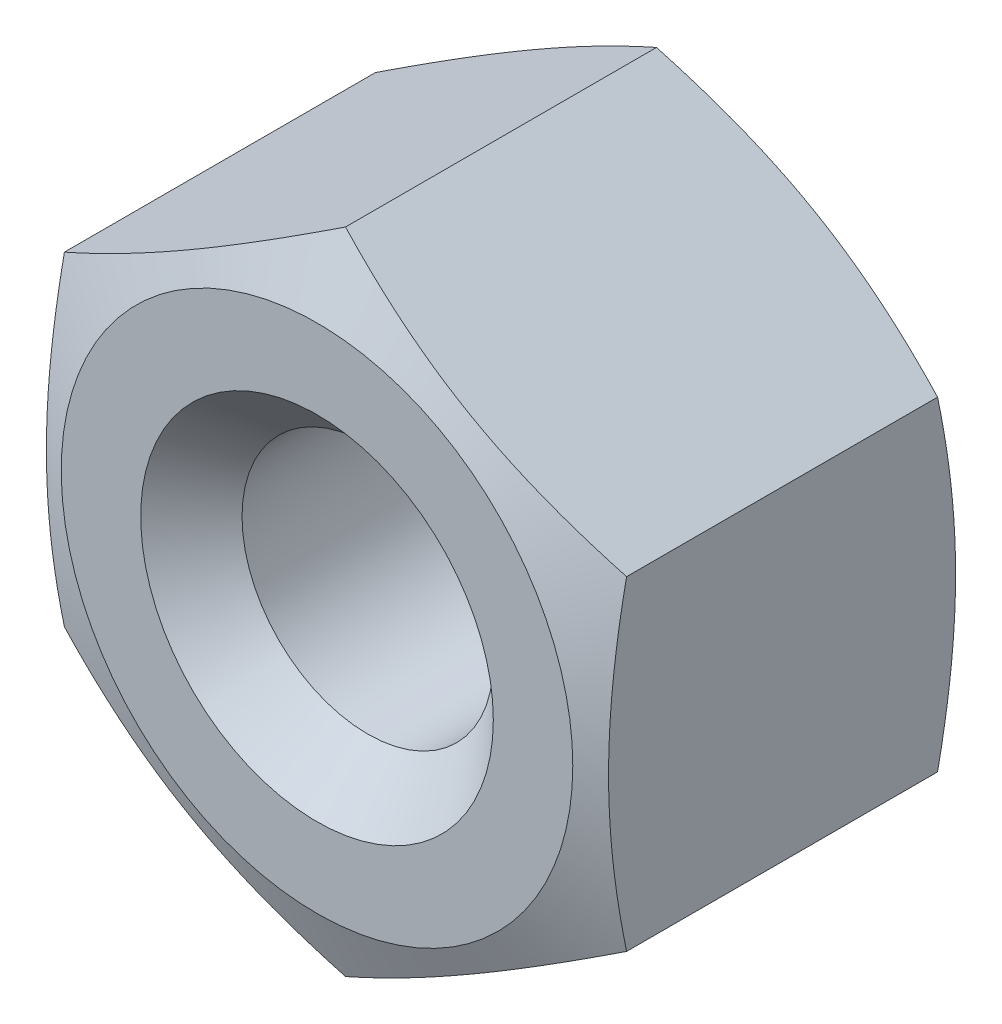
ISO-10303-21;
HEADER;
FILE_DESCRIPTION(('STEP AP214'),'2;1');
FILE_NAME('part.step','',(''),(''),'','','');
FILE_SCHEMA(('AUTOMOTIVE_DESIGN { 1 0 10303 214 1 1 1 1 }'));
ENDSEC;
DATA;
#1=APPLICATION_CONTEXT('core data for automotive mechanical design processes');
#2=APPLICATION_PROTOCOL_DEFINITION('international standard','automotive_design',2000,#1);
#3=PRODUCT_CONTEXT('',#1,'mechanical');
#4=PRODUCT('Part','Part','',(#3));
#5=PRODUCT_RELATED_PRODUCT_CATEGORY('part','',(#4));
#6=PRODUCT_DEFINITION_FORMATION('','',#4);
#7=PRODUCT_DEFINITION_CONTEXT('part definition',#1,'design');
#8=PRODUCT_DEFINITION('design','',#6,#7);
#9=PRODUCT_DEFINITION_SHAPE('','',#8);
#10=(LENGTH_UNIT() NAMED_UNIT(*) SI_UNIT(.MILLI.,.METRE.));
#11=(NAMED_UNIT(*) PLANE_ANGLE_UNIT() SI_UNIT($,.RADIAN.));
#12=(NAMED_UNIT(*) SI_UNIT($,.STERADIAN.) SOLID_ANGLE_UNIT());
#13=UNCERTAINTY_MEASURE_WITH_UNIT(LENGTH_MEASURE(1.E-05),#10,'distance_accuracy_value','');
#14=(GEOMETRIC_REPRESENTATION_CONTEXT(3) GLOBAL_UNCERTAINTY_ASSIGNED_CONTEXT((#13)) GLOBAL_UNIT_ASSIGNED_CONTEXT((#10,
#11,#12)) REPRESENTATION_CONTEXT('',''));
#15=CARTESIAN_POINT('',(0.,0.,0.));
#16=DIRECTION('',(0.,0.,1.));
#17=DIRECTION('',(1.,0.,0.));
#18=AXIS2_PLACEMENT_3D('',#15,#16,#17);
#19=CARTESIAN_POINT('',(0.,0.,0.));
#20=DIRECTION('',(0.,0.,1.));
#21=DIRECTION('',(1.,0.,0.));
#22=AXIS2_PLACEMENT_3D('',#19,#20,#21);
#23=PLANE('',#22);
#24=CARTESIAN_POINT('',(0.,0.,0.));
#25=DIRECTION('',(0.,0.,1.));
#26=DIRECTION('',(1.,0.,0.));
#27=AXIS2_PLACEMENT_3D('',#24,#25,#26);
#28=CIRCLE('',#27,1.725);
#29=CARTESIAN_POINT('',(1.725,0.,0.));
#30=VERTEX_POINT('',#29);
#31=EDGE_CURVE('E182',#30,#30,#28,.T.);
#32=ORIENTED_EDGE('',*,*,#31,.T.);
#33=EDGE_LOOP('',(#32));
#34=FACE_BOUND('',#33,.T.);
#35=CARTESIAN_POINT('',(0.,0.,0.));
#36=DIRECTION('',(0.,0.,1.));
#37=DIRECTION('',(1.,0.,0.));
#38=AXIS2_PLACEMENT_3D('',#35,#36,#37);
#39=CIRCLE('',#38,2.50241421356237);
#40=CARTESIAN_POINT('',(2.50241421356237,0.,0.));
#41=VERTEX_POINT('',#40);
#42=EDGE_CURVE('E270',#41,#41,#39,.T.);
#43=ORIENTED_EDGE('',*,*,#42,.F.);
#44=EDGE_LOOP('',(#43));
#45=FACE_BOUND('',#44,.T.);
#46=ADVANCED_FACE('F86',(#34,#45),#23,.F.);
#47=CARTESIAN_POINT('',(0.,-3.17542648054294,3.6));
#48=DIRECTION('',(-0.5,0.866025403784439,0.));
#49=DIRECTION('',(-0.866025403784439,-0.5,0.));
#50=AXIS2_PLACEMENT_3D('',#47,#48,#49);
#51=PLANE('',#50);
#52=CARTESIAN_POINT('',(2.7502,-1.58759777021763,0.278818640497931));
#53=CARTESIAN_POINT('',(2.65649248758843,-1.64169982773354,0.256405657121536));
#54=CARTESIAN_POINT('',(2.5624696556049,-1.69598393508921,0.235635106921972));
#55=CARTESIAN_POINT('',(2.37378809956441,-1.8049192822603,0.19798956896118));
#56=CARTESIAN_POINT('',(2.27912903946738,-1.85957071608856,0.181116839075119));
#57=CARTESIAN_POINT('',(2.08928522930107,-1.96917709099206,0.151906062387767));
#58=CARTESIAN_POINT('',(1.99410051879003,-2.02413200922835,0.139567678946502));
#59=CARTESIAN_POINT('',(1.80335450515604,-2.13425927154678,0.11997473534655));
#60=CARTESIAN_POINT('',(1.70779328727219,-2.18943156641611,0.112719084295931));
#61=CARTESIAN_POINT('',(1.51815924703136,-2.29891683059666,0.103732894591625));
#62=CARTESIAN_POINT('',(1.42408985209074,-2.35322782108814,0.101907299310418));
#63=CARTESIAN_POINT('',(1.23597987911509,-2.46183316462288,0.103605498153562));
#64=CARTESIAN_POINT('',(1.14193930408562,-2.51612751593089,0.107129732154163));
#65=CARTESIAN_POINT('',(0.95418505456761,-2.62452748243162,0.119343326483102));
#66=CARTESIAN_POINT('',(0.860471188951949,-2.67863320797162,0.12802884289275));
#67=CARTESIAN_POINT('',(0.673466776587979,-2.7866002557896,0.150153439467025));
#68=CARTESIAN_POINT('',(0.580176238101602,-2.84046157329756,0.163592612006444));
#69=CARTESIAN_POINT('',(0.446409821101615,-2.91769165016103,0.185940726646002));
#70=CARTESIAN_POINT('',(0.405714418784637,-2.94118715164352,0.193151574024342));
#71=CARTESIAN_POINT('',(0.324435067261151,-2.98811380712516,0.208328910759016));
#72=CARTESIAN_POINT('',(0.283851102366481,-3.01154497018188,0.21629528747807));
#73=CARTESIAN_POINT('',(0.202626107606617,-3.05844024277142,0.232968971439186));
#74=CARTESIAN_POINT('',(0.161985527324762,-3.08190409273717,0.241679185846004));
#75=CARTESIAN_POINT('',(0.0808114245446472,-3.12876998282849,0.25976349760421));
#76=CARTESIAN_POINT('',(0.0402779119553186,-3.15217201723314,0.26913765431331));
#77=CARTESIAN_POINT('',(-0.000199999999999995,-3.17554195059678,0.278818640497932));
#78=B_SPLINE_CURVE_WITH_KNOTS('',3,(#52,#53,#54,#55,#56,#57,#58,#59,#60,#61,#62,#63,#64,#65,#66,
#67,#68,#69,#70,#71,#72,#73,#74,#75,#76,#77),.UNSPECIFIED.,.F.,.F.,(4,2,2,2,2,2,2,2,2,2,2,2,4),
(0.,0.331525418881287,0.663242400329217,0.994934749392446,1.32655588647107,1.65233657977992,
1.9781440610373,2.30370919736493,2.62928066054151,2.77189936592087,2.91449684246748,
3.05767965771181,3.20087528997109),.UNSPECIFIED.);
#79=CARTESIAN_POINT('',(2.75,-1.58771324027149,0.278770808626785));
#80=VERTEX_POINT('',#79);
#81=CARTESIAN_POINT('',(0.,-3.17542648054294,0.278770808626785));
#82=VERTEX_POINT('',#81);
#83=EDGE_CURVE('E106',#80,#82,#78,.T.);
#84=ORIENTED_EDGE('',*,*,#83,.F.);
#85=DIRECTION('',(0.,0.,-1.));
#86=VECTOR('',#85,1.);
#87=CARTESIAN_POINT('',(2.75,-1.58771324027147,3.6));
#88=LINE('',#87,#86);
#89=CARTESIAN_POINT('',(2.75,-1.58771324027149,3.32122919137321));
#90=VERTEX_POINT('',#89);
#91=EDGE_CURVE('E173',#90,#80,#88,.T.);
#92=ORIENTED_EDGE('',*,*,#91,.F.);
#93=CARTESIAN_POINT('',(2.7502,-1.58759777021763,3.32118135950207));
#94=CARTESIAN_POINT('',(2.65649248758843,-1.64169982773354,3.34359434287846));
#95=CARTESIAN_POINT('',(2.5624696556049,-1.69598393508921,3.36436489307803));
#96=CARTESIAN_POINT('',(2.37378809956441,-1.8049192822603,3.40201043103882));
#97=CARTESIAN_POINT('',(2.27912903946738,-1.85957071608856,3.41888316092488));
#98=CARTESIAN_POINT('',(2.08928522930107,-1.96917709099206,3.44809393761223));
#99=CARTESIAN_POINT('',(1.99410051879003,-2.02413200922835,3.46043232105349));
#100=CARTESIAN_POINT('',(1.80335450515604,-2.13425927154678,3.48002526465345));
#101=CARTESIAN_POINT('',(1.70779328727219,-2.18943156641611,3.48728091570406));
#102=CARTESIAN_POINT('',(1.51815924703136,-2.29891683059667,3.49626710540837));
#103=CARTESIAN_POINT('',(1.42408985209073,-2.35322782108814,3.49809270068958));
#104=CARTESIAN_POINT('',(1.23597987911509,-2.46183316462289,3.49639450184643));
#105=CARTESIAN_POINT('',(1.14193930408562,-2.5161275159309,3.49287026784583));
#106=CARTESIAN_POINT('',(0.954185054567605,-2.62452748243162,3.4806566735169));
#107=CARTESIAN_POINT('',(0.860471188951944,-2.67863320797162,3.47197115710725));
#108=CARTESIAN_POINT('',(0.673466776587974,-2.78660025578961,3.44984656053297));
#109=CARTESIAN_POINT('',(0.580176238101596,-2.84046157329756,3.43640738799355));
#110=CARTESIAN_POINT('',(0.446409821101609,-2.91769165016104,3.41405927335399));
#111=CARTESIAN_POINT('',(0.405714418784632,-2.94118715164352,3.40684842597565));
#112=CARTESIAN_POINT('',(0.324435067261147,-2.98811380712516,3.39167108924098));
#113=CARTESIAN_POINT('',(0.283851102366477,-3.01154497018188,3.38370471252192));
#114=CARTESIAN_POINT('',(0.202626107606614,-3.05844024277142,3.36703102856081));
#115=CARTESIAN_POINT('',(0.16198552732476,-3.08190409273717,3.35832081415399));
#116=CARTESIAN_POINT('',(0.0808114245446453,-3.12876998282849,3.34023650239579));
#117=CARTESIAN_POINT('',(0.0402779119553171,-3.15217201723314,3.33086234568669));
#118=CARTESIAN_POINT('',(-0.000200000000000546,-3.17554195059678,3.32118135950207));
#119=B_SPLINE_CURVE_WITH_KNOTS('',3,(#93,#94,#95,#96,#97,#98,#99,#100,#101,#102,#103,#104,#105,
#106,#107,#108,#109,#110,#111,#112,#113,#114,#115,#116,#117,#118),.UNSPECIFIED.,.F.,.F.,(4,2,2,
2,2,2,2,2,2,2,2,2,4),(0.,0.331525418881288,0.663242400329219,0.994934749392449,1.32655588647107,
1.65233657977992,1.97814406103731,2.30370919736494,2.62928066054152,2.77189936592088,
2.91449684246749,3.05767965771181,3.20087528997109),.UNSPECIFIED.);
#120=CARTESIAN_POINT('',(0.,-3.17542648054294,3.32122919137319));
#121=VERTEX_POINT('',#120);
#122=EDGE_CURVE('E237',#90,#121,#119,.T.);
#123=ORIENTED_EDGE('',*,*,#122,.T.);
#124=DIRECTION('',(0.,0.,-1.));
#125=VECTOR('',#124,1.);
#126=CARTESIAN_POINT('',(0.,-3.17542648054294,3.6));
#127=LINE('',#126,#125);
#128=EDGE_CURVE('E160',#121,#82,#127,.T.);
#129=ORIENTED_EDGE('',*,*,#128,.T.);
#130=EDGE_LOOP('',(#84,#92,#123,#129));
#131=FACE_BOUND('',#130,.T.);
#132=ADVANCED_FACE('F247',(#131),#51,.F.);
#133=CARTESIAN_POINT('',(2.75,-1.58771324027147,3.6));
#134=DIRECTION('',(-1.,0.,0.));
#135=DIRECTION('',(0.,-1.,0.));
#136=AXIS2_PLACEMENT_3D('',#133,#134,#135);
#137=PLANE('',#136);
#138=CARTESIAN_POINT('',(2.75,-4.25926884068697,1.06348682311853));
#139=CARTESIAN_POINT('',(2.75,-4.13436725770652,1.02003517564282));
#140=CARTESIAN_POINT('',(2.75,-4.00929566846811,0.977063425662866));
#141=CARTESIAN_POINT('',(2.75,-3.7587236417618,0.892349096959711));
#142=CARTESIAN_POINT('',(2.75,-3.63322316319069,0.850606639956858));
#143=CARTESIAN_POINT('',(2.75,-3.38144046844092,0.768534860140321));
#144=CARTESIAN_POINT('',(2.75,-3.25515711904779,0.728209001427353));
#145=CARTESIAN_POINT('',(2.75,-3.00200316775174,0.649449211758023));
#146=CARTESIAN_POINT('',(2.75,-2.8751325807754,0.611015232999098));
#147=CARTESIAN_POINT('',(2.75,-2.62284671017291,0.537150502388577));
#148=CARTESIAN_POINT('',(2.75,-2.4974431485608,0.501679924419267));
#149=CARTESIAN_POINT('',(2.75,-2.24584835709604,0.433618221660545));
#150=CARTESIAN_POINT('',(2.75,-2.11965710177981,0.401027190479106));
#151=CARTESIAN_POINT('',(2.75,-1.86644410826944,0.339479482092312));
#152=CARTESIAN_POINT('',(2.75,-1.73942279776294,0.310521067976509));
#153=CARTESIAN_POINT('',(2.75,-1.48444023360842,0.257109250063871));
#154=CARTESIAN_POINT('',(2.75,-1.35647899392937,0.232655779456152));
#155=CARTESIAN_POINT('',(2.75,-1.02858663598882,0.177293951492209));
#156=CARTESIAN_POINT('',(2.75,-0.82795199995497,0.150283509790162));
#157=CARTESIAN_POINT('',(2.75,-0.5259343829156,0.122482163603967));
#158=CARTESIAN_POINT('',(2.75,-0.425118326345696,0.115334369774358));
#159=CARTESIAN_POINT('',(2.75,-0.223261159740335,0.105548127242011));
#160=CARTESIAN_POINT('',(2.75,-0.122220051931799,0.102909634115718));
#161=CARTESIAN_POINT('',(2.75,0.0806508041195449,0.102262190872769));
#162=CARTESIAN_POINT('',(2.75,0.18248066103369,0.104288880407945));
#163=CARTESIAN_POINT('',(2.75,0.385944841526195,0.11295245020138));
#164=CARTESIAN_POINT('',(2.75,0.487579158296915,0.119589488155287));
#165=CARTESIAN_POINT('',(2.75,0.690541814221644,0.13719619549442));
#166=CARTESIAN_POINT('',(2.75,0.791869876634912,0.148169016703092));
#167=CARTESIAN_POINT('',(2.75,0.994008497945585,0.174026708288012));
#168=CARTESIAN_POINT('',(2.75,1.09481910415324,0.188911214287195));
#169=CARTESIAN_POINT('',(2.75,1.3781699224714,0.235696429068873));
#170=CARTESIAN_POINT('',(2.75,1.56005795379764,0.271552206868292));
#171=CARTESIAN_POINT('',(2.75,1.92197705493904,0.351734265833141));
#172=CARTESIAN_POINT('',(2.75,2.10200732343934,0.396064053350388));
#173=CARTESIAN_POINT('',(2.75,2.46067602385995,0.490918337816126));
#174=CARTESIAN_POINT('',(2.75,2.63931218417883,0.541451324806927));
#175=CARTESIAN_POINT('',(2.75,2.99527415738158,0.646963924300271));
#176=CARTESIAN_POINT('',(2.75,3.17259982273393,0.701944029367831));
#177=CARTESIAN_POINT('',(2.75,3.52716056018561,0.81545260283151));
#178=CARTESIAN_POINT('',(2.75,3.70438998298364,0.87399861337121));
#179=CARTESIAN_POINT('',(2.75,4.05802971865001,0.993521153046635));
#180=CARTESIAN_POINT('',(2.75,4.23444000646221,1.05449775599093));
#181=CARTESIAN_POINT('',(2.75,4.58663196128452,1.17828972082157));
#182=CARTESIAN_POINT('',(2.75,4.76241356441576,1.24110526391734));
#183=CARTESIAN_POINT('',(2.75,5.11346735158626,1.36814481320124));
#184=CARTESIAN_POINT('',(2.75,5.28873953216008,1.4323688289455));
#185=CARTESIAN_POINT('',(2.75,5.63475370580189,1.56039185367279));
#186=CARTESIAN_POINT('',(2.75,5.80550518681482,1.62416525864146));
#187=CARTESIAN_POINT('',(2.75,6.1466834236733,1.75254586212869));
#188=CARTESIAN_POINT('',(2.75,6.31711019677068,1.81715301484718));
#189=CARTESIAN_POINT('',(2.75,6.65775203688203,1.94706166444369));
#190=CARTESIAN_POINT('',(2.75,6.82796703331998,2.01236334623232));
#191=CARTESIAN_POINT('',(2.75,7.16818507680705,2.14352382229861));
#192=CARTESIAN_POINT('',(2.75,7.33818812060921,2.20938262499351));
#193=CARTESIAN_POINT('',(2.75,7.84380976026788,2.4060363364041));
#194=CARTESIAN_POINT('',(2.75,8.17917194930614,2.53749006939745));
#195=CARTESIAN_POINT('',(2.75,8.84929277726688,2.80165013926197));
#196=CARTESIAN_POINT('',(2.75,9.18405156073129,2.93435610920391));
#197=CARTESIAN_POINT('',(2.75,9.51864689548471,3.06746636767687));
#198=B_SPLINE_CURVE_WITH_KNOTS('',3,(#138,#139,#140,#141,#142,#143,#144,#145,#146,#147,#148,
#149,#150,#151,#152,#153,#154,#155,#156,#157,#158,#159,#160,#161,#162,#163,#164,#165,#166,#167,
#168,#169,#170,#171,#172,#173,#174,#175,#176,#177,#178,#179,#180,#181,#182,#183,#184,#185,#186,
#187,#188,#189,#190,#191,#192,#193,#194,#195,#196,#197),.UNSPECIFIED.,.F.,.F.,(4,2,2,2,2,2,2,2,
2,2,2,2,2,2,2,2,2,2,2,2,2,2,2,2,2,2,2,2,2,4),(0.,0.396735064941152,0.793509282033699,
1.19119436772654,1.58886939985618,1.97981234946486,2.37076800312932,2.76153600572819,
3.15229821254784,3.75895018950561,4.06207230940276,4.36519144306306,4.67063393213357,
4.97608686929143,5.28176225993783,5.58740918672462,6.1432669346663,6.69935518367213,
7.2562131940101,7.81313296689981,8.37305712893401,8.93299830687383,9.49299484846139,
10.0529951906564,10.5998087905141,11.1465924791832,11.6935255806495,12.2404669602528,
13.321079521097,14.4013847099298),.UNSPECIFIED.);
#199=CARTESIAN_POINT('',(2.75,1.58771324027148,0.278770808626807));
#200=VERTEX_POINT('',#199);
#201=EDGE_CURVE('E253',#200,#80,#198,.F.);
#202=ORIENTED_EDGE('',*,*,#201,.F.);
#203=DIRECTION('',(0.,0.,-1.));
#204=VECTOR('',#203,1.);
#205=CARTESIAN_POINT('',(2.75,1.58771324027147,3.6));
#206=LINE('',#205,#204);
#207=CARTESIAN_POINT('',(2.75,1.58771324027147,3.32122919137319));
#208=VERTEX_POINT('',#207);
#209=EDGE_CURVE('E170',#208,#200,#206,.T.);
#210=ORIENTED_EDGE('',*,*,#209,.F.);
#211=CARTESIAN_POINT('',(2.75,-4.26202370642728,2.5355544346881));
#212=CARTESIAN_POINT('',(2.75,-4.13707946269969,2.57902920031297));
#213=CARTESIAN_POINT('',(2.75,-4.01196530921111,2.62202442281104));
#214=CARTESIAN_POINT('',(2.75,-3.761308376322,2.70678657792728));
#215=CARTESIAN_POINT('',(2.75,-3.63576555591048,2.74855338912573));
#216=CARTESIAN_POINT('',(2.75,-3.38390010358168,2.83067441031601));
#217=CARTESIAN_POINT('',(2.75,-3.25757634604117,2.87102518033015));
#218=CARTESIAN_POINT('',(2.75,-3.00434180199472,2.94983613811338));
#219=CARTESIAN_POINT('',(2.75,-2.87743103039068,2.9882963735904));
#220=CARTESIAN_POINT('',(2.75,-2.62508805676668,3.06220818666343));
#221=CARTESIAN_POINT('',(2.75,-2.49966769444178,3.09769997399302));
#222=CARTESIAN_POINT('',(2.75,-2.24803968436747,3.16580698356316));
#223=CARTESIAN_POINT('',(2.75,-2.1218320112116,3.19842211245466));
#224=CARTESIAN_POINT('',(2.75,-1.86858515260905,3.26002174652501));
#225=CARTESIAN_POINT('',(2.75,-1.74154638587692,3.28900795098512));
#226=CARTESIAN_POINT('',(2.75,-1.4865287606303,3.34247902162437));
#227=CARTESIAN_POINT('',(2.75,-1.35854991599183,3.36696395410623));
#228=CARTESIAN_POINT('',(2.75,-1.03059250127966,3.42241401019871));
#229=CARTESIAN_POINT('',(2.75,-0.829909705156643,3.44948251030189));
#230=CARTESIAN_POINT('',(2.75,-0.527817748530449,3.47737105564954));
#231=CARTESIAN_POINT('',(2.75,-0.42697725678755,3.48454791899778));
#232=CARTESIAN_POINT('',(2.75,-0.225069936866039,3.49439122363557));
#233=CARTESIAN_POINT('',(2.75,-0.12400311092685,3.49705770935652));
#234=CARTESIAN_POINT('',(2.75,0.078935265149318,3.49775905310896));
#235=CARTESIAN_POINT('',(2.75,0.180806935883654,3.49575757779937));
#236=CARTESIAN_POINT('',(2.75,0.384355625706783,3.48713964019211));
#237=CARTESIAN_POINT('',(2.75,0.486032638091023,3.48052302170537));
#238=CARTESIAN_POINT('',(2.75,0.689082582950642,3.46295174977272));
#239=CARTESIAN_POINT('',(2.75,0.790455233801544,3.45199388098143));
#240=CARTESIAN_POINT('',(2.75,0.992682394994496,3.42616075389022));
#241=CARTESIAN_POINT('',(2.75,1.09353695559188,3.41128588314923));
#242=CARTESIAN_POINT('',(2.75,1.38109653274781,3.36384727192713));
#243=CARTESIAN_POINT('',(2.75,1.56710696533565,3.32706660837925));
#244=CARTESIAN_POINT('',(2.75,1.93719042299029,3.24470307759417));
#245=CARTESIAN_POINT('',(2.75,2.12126255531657,3.19911632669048));
#246=CARTESIAN_POINT('',(2.75,2.48799540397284,3.10154679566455));
#247=CARTESIAN_POINT('',(2.75,2.6706534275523,3.04955401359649));
#248=CARTESIAN_POINT('',(2.75,3.03457024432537,2.94102937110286));
#249=CARTESIAN_POINT('',(2.75,3.21582925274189,2.88449822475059));
#250=CARTESIAN_POINT('',(2.75,3.57839797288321,2.76777619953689));
#251=CARTESIAN_POINT('',(2.75,3.75970104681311,2.70756482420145));
#252=CARTESIAN_POINT('',(2.75,4.12147218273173,2.58467809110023));
#253=CARTESIAN_POINT('',(2.75,4.30194022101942,2.52200266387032));
#254=CARTESIAN_POINT('',(2.75,4.66205870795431,2.39486012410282));
#255=CARTESIAN_POINT('',(2.75,4.84170974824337,2.33039468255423));
#256=CARTESIAN_POINT('',(2.75,5.20049764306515,2.20004669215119));
#257=CARTESIAN_POINT('',(2.75,5.3796344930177,2.13416413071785));
#258=CARTESIAN_POINT('',(2.75,5.90765979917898,1.93813710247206));
#259=CARTESIAN_POINT('',(2.75,6.25597901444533,1.80646077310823));
#260=CARTESIAN_POINT('',(2.75,6.95169162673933,1.54042009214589));
#261=CARTESIAN_POINT('',(2.75,7.29908474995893,1.40605502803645));
#262=CARTESIAN_POINT('',(2.75,7.98887957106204,1.13719779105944));
#263=CARTESIAN_POINT('',(2.75,8.33128989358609,1.00272771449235));
#264=CARTESIAN_POINT('',(2.75,9.01550460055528,0.732549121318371));
#265=CARTESIAN_POINT('',(2.75,9.35730913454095,0.59684098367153));
#266=CARTESIAN_POINT('',(2.75,9.69895168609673,0.460731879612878));
#267=B_SPLINE_CURVE_WITH_KNOTS('',3,(#211,#212,#213,#214,#215,#216,#217,#218,#219,#220,#221,
#222,#223,#224,#225,#226,#227,#228,#229,#230,#231,#232,#233,#234,#235,#236,#237,#238,#239,#240,
#241,#242,#243,#244,#245,#246,#247,#248,#249,#250,#251,#252,#253,#254,#255,#256,#257,#258,#259,
#260,#261,#262,#263,#264,#265,#266),.UNSPECIFIED.,.F.,.F.,(4,2,2,2,2,2,2,2,2,2,2,2,2,2,2,2,2,2,
2,2,2,2,2,2,2,2,2,4),(0.,0.39687872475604,0.793796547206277,1.19161986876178,1.58943314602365,
1.98044197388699,2.37146348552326,2.76230120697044,3.15313317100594,3.75995203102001,
4.06315343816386,4.36635185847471,4.67191810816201,4.97749469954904,5.28329804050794,
5.58907113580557,6.15757836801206,6.72633689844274,7.2959949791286,7.86556360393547,
8.43865954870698,9.01177166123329,9.5843656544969,10.1569647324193,11.2740769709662,
12.391489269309,13.4950908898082,14.5983653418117),.UNSPECIFIED.);
#268=EDGE_CURVE('E230',#208,#90,#267,.F.);
#269=ORIENTED_EDGE('',*,*,#268,.T.);
#270=ORIENTED_EDGE('',*,*,#91,.T.);
#271=EDGE_LOOP('',(#202,#210,#269,#270));
#272=FACE_BOUND('',#271,.T.);
#273=ADVANCED_FACE('F243',(#272),#137,.F.);
#274=CARTESIAN_POINT('',(2.75,1.58771324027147,3.6));
#275=DIRECTION('',(-0.5,-0.866025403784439,0.));
#276=DIRECTION('',(0.866025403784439,-0.5,0.));
#277=AXIS2_PLACEMENT_3D('',#274,#275,#276);
#278=PLANE('',#277);
#279=CARTESIAN_POINT('',(-0.000200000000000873,3.17554195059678,0.278818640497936));
#280=CARTESIAN_POINT('',(0.0935075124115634,3.12143989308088,0.256405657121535));
#281=CARTESIAN_POINT('',(0.187530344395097,3.06715578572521,0.235635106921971));
#282=CARTESIAN_POINT('',(0.37621190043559,2.95822043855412,0.19798956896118));
#283=CARTESIAN_POINT('',(0.470870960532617,2.90356900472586,0.181116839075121));
#284=CARTESIAN_POINT('',(0.660714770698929,2.79396262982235,0.151906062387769));
#285=CARTESIAN_POINT('',(0.75589948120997,2.73900771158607,0.139567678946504));
#286=CARTESIAN_POINT('',(0.94664549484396,2.62888044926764,0.119974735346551));
#287=CARTESIAN_POINT('',(1.04220671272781,2.57370815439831,0.112719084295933));
#288=CARTESIAN_POINT('',(1.23184075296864,2.46422289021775,0.103732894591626));
#289=CARTESIAN_POINT('',(1.32591014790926,2.40991189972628,0.101907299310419));
#290=CARTESIAN_POINT('',(1.51402012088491,2.30130655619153,0.103605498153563));
#291=CARTESIAN_POINT('',(1.60806069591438,2.24701220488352,0.107129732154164));
#292=CARTESIAN_POINT('',(1.79581494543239,2.1386122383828,0.119343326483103));
#293=CARTESIAN_POINT('',(1.88952881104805,2.0845065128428,0.128028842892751));
#294=CARTESIAN_POINT('',(2.07653322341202,1.97653946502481,0.150153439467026));
#295=CARTESIAN_POINT('',(2.1698237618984,1.92267814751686,0.163592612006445));
#296=CARTESIAN_POINT('',(2.30359017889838,1.84544807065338,0.185940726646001));
#297=CARTESIAN_POINT('',(2.34428558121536,1.8219525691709,0.193151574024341));
#298=CARTESIAN_POINT('',(2.42556493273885,1.77502591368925,0.208328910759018));
#299=CARTESIAN_POINT('',(2.46614889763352,1.75159475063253,0.216295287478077));
#300=CARTESIAN_POINT('',(2.54737389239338,1.704699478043,0.232968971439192));
#301=CARTESIAN_POINT('',(2.58801447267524,1.68123562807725,0.241679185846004));
#302=CARTESIAN_POINT('',(2.66918857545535,1.63436973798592,0.259763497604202));
#303=CARTESIAN_POINT('',(2.70972208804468,1.61096770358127,0.2691376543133));
#304=CARTESIAN_POINT('',(2.7502,1.58759777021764,0.278818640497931));
#305=B_SPLINE_CURVE_WITH_KNOTS('',3,(#279,#280,#281,#282,#283,#284,#285,#286,#287,#288,#289,
#290,#291,#292,#293,#294,#295,#296,#297,#298,#299,#300,#301,#302,#303,#304),.UNSPECIFIED.,.F.,
.F.,(4,2,2,2,2,2,2,2,2,2,2,2,4),(0.,0.331525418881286,0.663242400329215,0.994934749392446,
1.32655588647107,1.65233657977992,1.97814406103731,2.30370919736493,2.62928066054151,
2.77189936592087,2.91449684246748,3.05767965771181,3.20087528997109),.UNSPECIFIED.);
#306=CARTESIAN_POINT('',(0.,3.17542648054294,0.278770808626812));
#307=VERTEX_POINT('',#306);
#308=EDGE_CURVE('E260',#307,#200,#305,.T.);
#309=ORIENTED_EDGE('',*,*,#308,.F.);
#310=DIRECTION('',(0.,0.,-1.));
#311=VECTOR('',#310,1.);
#312=CARTESIAN_POINT('',(0.,3.17542648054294,3.6));
#313=LINE('',#312,#311);
#314=CARTESIAN_POINT('',(0.,3.17542648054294,3.32122919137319));
#315=VERTEX_POINT('',#314);
#316=EDGE_CURVE('E162',#315,#307,#313,.T.);
#317=ORIENTED_EDGE('',*,*,#316,.F.);
#318=CARTESIAN_POINT('',(-0.000200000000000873,3.17554195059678,3.32118135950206));
#319=CARTESIAN_POINT('',(0.0935075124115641,3.12143989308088,3.34359434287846));
#320=CARTESIAN_POINT('',(0.187530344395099,3.06715578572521,3.36436489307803));
#321=CARTESIAN_POINT('',(0.376211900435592,2.95822043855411,3.40201043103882));
#322=CARTESIAN_POINT('',(0.47087096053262,2.90356900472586,3.41888316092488));
#323=CARTESIAN_POINT('',(0.660714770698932,2.79396262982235,3.44809393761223));
#324=CARTESIAN_POINT('',(0.755899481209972,2.73900771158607,3.46043232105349));
#325=CARTESIAN_POINT('',(0.946645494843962,2.62888044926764,3.48002526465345));
#326=CARTESIAN_POINT('',(1.04220671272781,2.57370815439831,3.48728091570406));
#327=CARTESIAN_POINT('',(1.23184075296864,2.46422289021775,3.49626710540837));
#328=CARTESIAN_POINT('',(1.32591014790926,2.40991189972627,3.49809270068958));
#329=CARTESIAN_POINT('',(1.51402012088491,2.30130655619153,3.49639450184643));
#330=CARTESIAN_POINT('',(1.60806069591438,2.24701220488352,3.49287026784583));
#331=CARTESIAN_POINT('',(1.79581494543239,2.1386122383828,3.4806566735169));
#332=CARTESIAN_POINT('',(1.88952881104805,2.0845065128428,3.47197115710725));
#333=CARTESIAN_POINT('',(2.07653322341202,1.97653946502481,3.44984656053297));
#334=CARTESIAN_POINT('',(2.1698237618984,1.92267814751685,3.43640738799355));
#335=CARTESIAN_POINT('',(2.30359017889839,1.84544807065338,3.41405927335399));
#336=CARTESIAN_POINT('',(2.34428558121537,1.82195256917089,3.40684842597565));
#337=CARTESIAN_POINT('',(2.42556493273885,1.77502591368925,3.39167108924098));
#338=CARTESIAN_POINT('',(2.46614889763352,1.75159475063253,3.38370471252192));
#339=CARTESIAN_POINT('',(2.54737389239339,1.704699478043,3.36703102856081));
#340=CARTESIAN_POINT('',(2.58801447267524,1.68123562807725,3.35832081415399));
#341=CARTESIAN_POINT('',(2.66918857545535,1.63436973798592,3.34023650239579));
#342=CARTESIAN_POINT('',(2.70972208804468,1.61096770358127,3.33086234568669));
#343=CARTESIAN_POINT('',(2.7502,1.58759777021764,3.32118135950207));
#344=B_SPLINE_CURVE_WITH_KNOTS('',3,(#318,#319,#320,#321,#322,#323,#324,#325,#326,#327,#328,
#329,#330,#331,#332,#333,#334,#335,#336,#337,#338,#339,#340,#341,#342,#343),.UNSPECIFIED.,.F.,
.F.,(4,2,2,2,2,2,2,2,2,2,2,2,4),(0.,0.331525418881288,0.663242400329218,0.994934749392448,
1.32655588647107,1.65233657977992,1.97814406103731,2.30370919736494,2.62928066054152,
2.77189936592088,2.91449684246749,3.05767965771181,3.2008752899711),.UNSPECIFIED.);
#345=EDGE_CURVE('E223',#315,#208,#344,.T.);
#346=ORIENTED_EDGE('',*,*,#345,.T.);
#347=ORIENTED_EDGE('',*,*,#209,.T.);
#348=EDGE_LOOP('',(#309,#317,#346,#347));
#349=FACE_BOUND('',#348,.T.);
#350=ADVANCED_FACE('F246',(#349),#278,.F.);
#351=CARTESIAN_POINT('',(0.,3.17542648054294,3.6));
#352=DIRECTION('',(0.5,-0.866025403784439,0.));
#353=DIRECTION('',(0.866025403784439,0.5,0.));
#354=AXIS2_PLACEMENT_3D('',#351,#352,#353);
#355=PLANE('',#354);
#356=CARTESIAN_POINT('',(-2.7502,1.58759777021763,0.278818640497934));
#357=CARTESIAN_POINT('',(-2.65649248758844,1.64169982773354,0.256405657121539));
#358=CARTESIAN_POINT('',(-2.5624696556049,1.69598393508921,0.235635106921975));
#359=CARTESIAN_POINT('',(-2.37378809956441,1.8049192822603,0.197989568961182));
#360=CARTESIAN_POINT('',(-2.27912903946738,1.85957071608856,0.18111683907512));
#361=CARTESIAN_POINT('',(-2.08928522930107,1.96917709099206,0.151906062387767));
#362=CARTESIAN_POINT('',(-1.99410051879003,2.02413200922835,0.139567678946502));
#363=CARTESIAN_POINT('',(-1.80335450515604,2.13425927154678,0.119974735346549));
#364=CARTESIAN_POINT('',(-1.70779328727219,2.18943156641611,0.11271908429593));
#365=CARTESIAN_POINT('',(-1.51815924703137,2.29891683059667,0.103732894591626));
#366=CARTESIAN_POINT('',(-1.42408985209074,2.35322782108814,0.101907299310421));
#367=CARTESIAN_POINT('',(-1.23597987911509,2.46183316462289,0.103605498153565));
#368=CARTESIAN_POINT('',(-1.14193930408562,2.51612751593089,0.107129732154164));
#369=CARTESIAN_POINT('',(-0.954185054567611,2.62452748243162,0.119343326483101));
#370=CARTESIAN_POINT('',(-0.86047118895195,2.67863320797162,0.128028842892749));
#371=CARTESIAN_POINT('',(-0.67346677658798,2.78660025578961,0.150153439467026));
#372=CARTESIAN_POINT('',(-0.580176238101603,2.84046157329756,0.163592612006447));
#373=CARTESIAN_POINT('',(-0.446409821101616,2.91769165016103,0.185940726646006));
#374=CARTESIAN_POINT('',(-0.405714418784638,2.94118715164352,0.193151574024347));
#375=CARTESIAN_POINT('',(-0.324435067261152,2.98811380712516,0.208328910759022));
#376=CARTESIAN_POINT('',(-0.283851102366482,3.01154497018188,0.216295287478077));
#377=CARTESIAN_POINT('',(-0.202626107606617,3.05844024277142,0.23296897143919));
#378=CARTESIAN_POINT('',(-0.161985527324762,3.08190409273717,0.241679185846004));
#379=CARTESIAN_POINT('',(-0.0808114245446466,3.1287699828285,0.259763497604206));
#380=CARTESIAN_POINT('',(-0.0402779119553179,3.15217201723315,0.269137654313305));
#381=CARTESIAN_POINT('',(0.000199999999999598,3.17554195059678,0.278818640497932));
#382=B_SPLINE_CURVE_WITH_KNOTS('',3,(#356,#357,#358,#359,#360,#361,#362,#363,#364,#365,#366,
#367,#368,#369,#370,#371,#372,#373,#374,#375,#376,#377,#378,#379,#380,#381),.UNSPECIFIED.,.F.,
.F.,(4,2,2,2,2,2,2,2,2,2,2,2,4),(0.,0.331525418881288,0.663242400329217,0.994934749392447,
1.32655588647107,1.65233657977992,1.97814406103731,2.30370919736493,2.62928066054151,
2.77189936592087,2.91449684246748,3.05767965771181,3.2008752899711),.UNSPECIFIED.);
#383=CARTESIAN_POINT('',(-2.75,1.58771324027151,0.278770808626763));
#384=VERTEX_POINT('',#383);
#385=EDGE_CURVE('E157',#384,#307,#382,.T.);
#386=ORIENTED_EDGE('',*,*,#385,.F.);
#387=DIRECTION('',(0.,0.,-1.));
#388=VECTOR('',#387,1.);
#389=CARTESIAN_POINT('',(-2.75,1.58771324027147,3.6));
#390=LINE('',#389,#388);
#391=CARTESIAN_POINT('',(-2.75,1.58771324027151,3.32122919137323));
#392=VERTEX_POINT('',#391);
#393=EDGE_CURVE('E156',#392,#384,#390,.T.);
#394=ORIENTED_EDGE('',*,*,#393,.F.);
#395=CARTESIAN_POINT('',(-2.7502,1.58759777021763,3.32118135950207));
#396=CARTESIAN_POINT('',(-2.65649248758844,1.64169982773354,3.34359434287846));
#397=CARTESIAN_POINT('',(-2.5624696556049,1.69598393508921,3.36436489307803));
#398=CARTESIAN_POINT('',(-2.37378809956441,1.8049192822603,3.40201043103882));
#399=CARTESIAN_POINT('',(-2.27912903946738,1.85957071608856,3.41888316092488));
#400=CARTESIAN_POINT('',(-2.08928522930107,1.96917709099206,3.44809393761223));
#401=CARTESIAN_POINT('',(-1.99410051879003,2.02413200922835,3.46043232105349));
#402=CARTESIAN_POINT('',(-1.80335450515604,2.13425927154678,3.48002526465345));
#403=CARTESIAN_POINT('',(-1.70779328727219,2.18943156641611,3.48728091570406));
#404=CARTESIAN_POINT('',(-1.51815924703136,2.29891683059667,3.49626710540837));
#405=CARTESIAN_POINT('',(-1.42408985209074,2.35322782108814,3.49809270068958));
#406=CARTESIAN_POINT('',(-1.23597987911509,2.46183316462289,3.49639450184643));
#407=CARTESIAN_POINT('',(-1.14193930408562,2.5161275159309,3.49287026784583));
#408=CARTESIAN_POINT('',(-0.954185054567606,2.62452748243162,3.48065667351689));
#409=CARTESIAN_POINT('',(-0.860471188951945,2.67863320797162,3.47197115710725));
#410=CARTESIAN_POINT('',(-0.673466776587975,2.78660025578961,3.44984656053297));
#411=CARTESIAN_POINT('',(-0.580176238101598,2.84046157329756,3.43640738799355));
#412=CARTESIAN_POINT('',(-0.446409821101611,2.91769165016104,3.41405927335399));
#413=CARTESIAN_POINT('',(-0.405714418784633,2.94118715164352,3.40684842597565));
#414=CARTESIAN_POINT('',(-0.324435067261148,2.98811380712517,3.39167108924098));
#415=CARTESIAN_POINT('',(-0.283851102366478,3.01154497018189,3.38370471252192));
#416=CARTESIAN_POINT('',(-0.202626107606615,3.05844024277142,3.36703102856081));
#417=CARTESIAN_POINT('',(-0.161985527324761,3.08190409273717,3.35832081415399));
#418=CARTESIAN_POINT('',(-0.0808114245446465,3.1287699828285,3.34023650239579));
#419=CARTESIAN_POINT('',(-0.0402779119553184,3.15217201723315,3.33086234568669));
#420=CARTESIAN_POINT('',(0.000199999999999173,3.17554195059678,3.32118135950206));
#421=B_SPLINE_CURVE_WITH_KNOTS('',3,(#395,#396,#397,#398,#399,#400,#401,#402,#403,#404,#405,
#406,#407,#408,#409,#410,#411,#412,#413,#414,#415,#416,#417,#418,#419,#420),.UNSPECIFIED.,.F.,
.F.,(4,2,2,2,2,2,2,2,2,2,2,2,4),(0.,0.331525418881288,0.663242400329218,0.994934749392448,
1.32655588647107,1.65233657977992,1.97814406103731,2.30370919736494,2.62928066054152,
2.77189936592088,2.91449684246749,3.05767965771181,3.20087528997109),.UNSPECIFIED.);
#422=EDGE_CURVE('E216',#392,#315,#421,.T.);
#423=ORIENTED_EDGE('',*,*,#422,.T.);
#424=ORIENTED_EDGE('',*,*,#316,.T.);
#425=EDGE_LOOP('',(#386,#394,#423,#424));
#426=FACE_BOUND('',#425,.T.);
#427=ADVANCED_FACE('F365',(#426),#355,.F.);
#428=CARTESIAN_POINT('',(-2.75,1.58771324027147,3.6));
#429=DIRECTION('',(1.,0.,0.));
#430=DIRECTION('',(0.,0.,-1.));
#431=AXIS2_PLACEMENT_3D('',#428,#429,#430);
#432=PLANE('',#431);
#433=CARTESIAN_POINT('',(-2.75,-4.25926884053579,1.06348682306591));
#434=CARTESIAN_POINT('',(-2.75,-4.13436725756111,1.02003517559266));
#435=CARTESIAN_POINT('',(-2.75,-4.00929566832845,0.977063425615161));
#436=CARTESIAN_POINT('',(-2.75,-3.75872364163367,0.892349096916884));
#437=CARTESIAN_POINT('',(-2.75,-3.63322316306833,0.850606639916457));
#438=CARTESIAN_POINT('',(-2.75,-3.38144046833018,0.768534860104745));
#439=CARTESIAN_POINT('',(-2.75,-3.25515711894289,0.728209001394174));
#440=CARTESIAN_POINT('',(-2.75,-3.00200316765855,0.649449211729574));
#441=CARTESIAN_POINT('',(-2.75,-2.87513258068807,0.611015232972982));
#442=CARTESIAN_POINT('',(-2.75,-2.62284671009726,0.537150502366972));
#443=CARTESIAN_POINT('',(-2.75,-2.49744314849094,0.501679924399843));
#444=CARTESIAN_POINT('',(-2.75,-2.24584835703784,0.433618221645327));
#445=CARTESIAN_POINT('',(-2.75,-2.11965710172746,0.401027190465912));
#446=CARTESIAN_POINT('',(-2.75,-1.86644410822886,0.33947948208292));
#447=CARTESIAN_POINT('',(-2.75,-1.73942279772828,0.310521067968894));
#448=CARTESIAN_POINT('',(-2.75,-1.48444023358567,0.257109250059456));
#449=CARTESIAN_POINT('',(-2.75,-1.35647899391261,0.232655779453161));
#450=CARTESIAN_POINT('',(-2.75,-1.02858663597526,0.177293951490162));
#451=CARTESIAN_POINT('',(-2.75,-0.827951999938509,0.15028350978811));
#452=CARTESIAN_POINT('',(-2.75,-0.525934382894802,0.122482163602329));
#453=CARTESIAN_POINT('',(-2.75,-0.425118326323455,0.11533436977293));
#454=CARTESIAN_POINT('',(-2.75,-0.223261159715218,0.105548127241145));
#455=CARTESIAN_POINT('',(-2.75,-0.122220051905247,0.102909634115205));
#456=CARTESIAN_POINT('',(-2.75,0.080650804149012,0.1022621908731));
#457=CARTESIAN_POINT('',(-2.75,0.182480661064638,0.104288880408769));
#458=CARTESIAN_POINT('',(-2.75,0.385944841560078,0.112952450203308));
#459=CARTESIAN_POINT('',(-2.75,0.487579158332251,0.119589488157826));
#460=CARTESIAN_POINT('',(-2.75,0.690541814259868,0.137196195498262));
#461=CARTESIAN_POINT('',(-2.75,0.791869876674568,0.148169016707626));
#462=CARTESIAN_POINT('',(-2.75,0.994008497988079,0.174026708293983));
#463=CARTESIAN_POINT('',(-2.75,1.09481910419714,0.188911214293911));
#464=CARTESIAN_POINT('',(-2.75,1.37816992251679,0.235696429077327));
#465=CARTESIAN_POINT('',(-2.75,1.56005795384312,0.271552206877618));
#466=CARTESIAN_POINT('',(-2.75,1.92197705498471,0.351734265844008));
#467=CARTESIAN_POINT('',(-2.75,2.1020073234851,0.396064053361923));
#468=CARTESIAN_POINT('',(-2.75,2.46067602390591,0.490918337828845));
#469=CARTESIAN_POINT('',(-2.75,2.6393121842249,0.541451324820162));
#470=CARTESIAN_POINT('',(-2.75,2.99527415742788,0.64696392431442));
#471=CARTESIAN_POINT('',(-2.75,3.17259982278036,0.701944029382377));
#472=CARTESIAN_POINT('',(-2.75,3.52716056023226,0.81545260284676));
#473=CARTESIAN_POINT('',(-2.75,3.70438998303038,0.873998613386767));
#474=CARTESIAN_POINT('',(-2.75,4.05802971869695,0.993521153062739));
#475=CARTESIAN_POINT('',(-2.75,4.23444000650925,1.05449775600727));
#476=CARTESIAN_POINT('',(-2.75,4.5866319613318,1.17828972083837));
#477=CARTESIAN_POINT('',(-2.75,4.76241356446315,1.24110526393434));
#478=CARTESIAN_POINT('',(-2.75,5.1134673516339,1.36814481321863));
#479=CARTESIAN_POINT('',(-2.75,5.28873953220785,1.43236882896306));
#480=CARTESIAN_POINT('',(-2.75,5.63475370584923,1.56039185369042));
#481=CARTESIAN_POINT('',(-2.75,5.80550518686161,1.62416525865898));
#482=CARTESIAN_POINT('',(-2.75,6.146683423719,1.75254586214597));
#483=CARTESIAN_POINT('',(-2.75,6.31711019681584,1.81715301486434));
#484=CARTESIAN_POINT('',(-2.75,6.6577520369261,1.94706166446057));
#485=CARTESIAN_POINT('',(-2.75,6.82796703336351,2.01236334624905));
#486=CARTESIAN_POINT('',(-2.75,7.16818507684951,2.14352382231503));
#487=CARTESIAN_POINT('',(-2.75,7.33818812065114,2.20938262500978));
#488=CARTESIAN_POINT('',(-2.75,7.84380976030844,2.40603633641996));
#489=CARTESIAN_POINT('',(-2.75,8.17917194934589,2.53749006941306));
#490=CARTESIAN_POINT('',(-2.75,8.849292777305,2.80165013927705));
#491=CARTESIAN_POINT('',(-2.75,9.1840515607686,2.93435610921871));
#492=CARTESIAN_POINT('',(-2.75,9.51864689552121,3.06746636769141));
#493=B_SPLINE_CURVE_WITH_KNOTS('',3,(#433,#434,#435,#436,#437,#438,#439,#440,#441,#442,#443,
#444,#445,#446,#447,#448,#449,#450,#451,#452,#453,#454,#455,#456,#457,#458,#459,#460,#461,#462,
#463,#464,#465,#466,#467,#468,#469,#470,#471,#472,#473,#474,#475,#476,#477,#478,#479,#480,#481,
#482,#483,#484,#485,#486,#487,#488,#489,#490,#491,#492),.UNSPECIFIED.,.F.,.F.,(4,2,2,2,2,2,2,2,
2,2,2,2,2,2,2,2,2,2,2,2,2,2,2,2,2,2,2,2,2,4),(0.,0.396735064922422,0.793509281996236,
1.1911943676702,1.58886939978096,1.97981234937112,2.37076800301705,2.76153600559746,
3.15229821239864,3.75895018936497,4.06207230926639,4.36519144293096,4.67063393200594,
4.97608686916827,5.28176225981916,5.58740918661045,6.1432669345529,6.6993551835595,
7.2562131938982,7.81313296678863,8.37305712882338,8.93299830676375,9.49299484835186,
10.0529951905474,10.5998087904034,11.1465924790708,11.6935255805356,12.2404669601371,
13.3210795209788,14.401384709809),.UNSPECIFIED.);
#494=CARTESIAN_POINT('',(-2.75,-1.58771324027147,0.278770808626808));
#495=VERTEX_POINT('',#494);
#496=EDGE_CURVE('E144',#495,#384,#493,.T.);
#497=ORIENTED_EDGE('',*,*,#496,.F.);
#498=DIRECTION('',(0.,0.,-1.));
#499=VECTOR('',#498,1.);
#500=CARTESIAN_POINT('',(-2.75,-1.58771324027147,3.6));
#501=LINE('',#500,#499);
#502=CARTESIAN_POINT('',(-2.75,-1.58771324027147,3.32122919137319));
#503=VERTEX_POINT('',#502);
#504=EDGE_CURVE('E154',#503,#495,#501,.T.);
#505=ORIENTED_EDGE('',*,*,#504,.F.);
#506=CARTESIAN_POINT('',(-2.75,-4.26202370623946,2.53555443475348));
#507=CARTESIAN_POINT('',(-2.75,-4.13707946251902,2.57902920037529));
#508=CARTESIAN_POINT('',(-2.75,-4.0119653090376,2.62202442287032));
#509=CARTESIAN_POINT('',(-2.75,-3.76130837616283,2.7067865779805));
#510=CARTESIAN_POINT('',(-2.75,-3.63576555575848,2.74855338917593));
#511=CARTESIAN_POINT('',(-2.75,-3.38390010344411,2.83067441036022));
#512=CARTESIAN_POINT('',(-2.75,-3.25757634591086,2.87102518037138));
#513=CARTESIAN_POINT('',(-2.75,-3.00434180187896,2.94983613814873));
#514=CARTESIAN_POINT('',(-2.75,-2.87743103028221,2.98829637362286));
#515=CARTESIAN_POINT('',(-2.75,-2.62508805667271,3.06220818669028));
#516=CARTESIAN_POINT('',(-2.75,-2.49966769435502,3.09769997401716));
#517=CARTESIAN_POINT('',(-2.75,-2.24803968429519,3.16580698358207));
#518=CARTESIAN_POINT('',(-2.75,-2.12183201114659,3.19842211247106));
#519=CARTESIAN_POINT('',(-2.75,-1.86858515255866,3.26002174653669));
#520=CARTESIAN_POINT('',(-2.75,-1.74154638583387,3.28900795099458));
#521=CARTESIAN_POINT('',(-2.75,-1.48652876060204,3.34247902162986));
#522=CARTESIAN_POINT('',(-2.75,-1.35854991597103,3.36696395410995));
#523=CARTESIAN_POINT('',(-2.75,-1.0305925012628,3.42241401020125));
#524=CARTESIAN_POINT('',(-2.75,-0.829909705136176,3.44948251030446));
#525=CARTESIAN_POINT('',(-2.75,-0.527817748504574,3.47737105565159));
#526=CARTESIAN_POINT('',(-2.75,-0.426977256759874,3.48454791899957));
#527=CARTESIAN_POINT('',(-2.75,-0.225069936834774,3.49439122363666));
#528=CARTESIAN_POINT('',(-2.75,-0.124003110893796,3.49705770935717));
#529=CARTESIAN_POINT('',(-2.75,0.0789352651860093,3.49775905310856));
#530=CARTESIAN_POINT('',(-2.75,0.180806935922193,3.49575757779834));
#531=CARTESIAN_POINT('',(-2.75,0.384355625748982,3.48713964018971));
#532=CARTESIAN_POINT('',(-2.75,0.486032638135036,3.48052302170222));
#533=CARTESIAN_POINT('',(-2.75,0.689082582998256,3.46295174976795));
#534=CARTESIAN_POINT('',(-2.75,0.790455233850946,3.45199388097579));
#535=CARTESIAN_POINT('',(-2.75,0.992682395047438,3.42616075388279));
#536=CARTESIAN_POINT('',(-2.75,1.09353695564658,3.41128588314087));
#537=CARTESIAN_POINT('',(-2.75,1.38109653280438,3.36384727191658));
#538=CARTESIAN_POINT('',(-2.75,1.56710696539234,3.32706660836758));
#539=CARTESIAN_POINT('',(-2.75,1.93719042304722,3.24470307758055));
#540=CARTESIAN_POINT('',(-2.75,2.12126255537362,3.19911632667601));
#541=CARTESIAN_POINT('',(-2.75,2.48799540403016,3.10154679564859));
#542=CARTESIAN_POINT('',(-2.75,2.67065342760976,3.04955401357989));
#543=CARTESIAN_POINT('',(-2.75,3.03457024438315,2.94102937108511));
#544=CARTESIAN_POINT('',(-2.75,3.21582925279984,2.88449822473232));
#545=CARTESIAN_POINT('',(-2.75,3.57839797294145,2.76777619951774));
#546=CARTESIAN_POINT('',(-2.75,3.75970104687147,2.70756482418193));
#547=CARTESIAN_POINT('',(-2.75,4.12147218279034,2.58467809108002));
#548=CARTESIAN_POINT('',(-2.75,4.30194022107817,2.52200266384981));
#549=CARTESIAN_POINT('',(-2.75,4.66205870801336,2.39486012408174));
#550=CARTESIAN_POINT('',(-2.75,4.84170974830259,2.3303946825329));
#551=CARTESIAN_POINT('',(-2.75,5.2004976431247,2.20004669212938));
#552=CARTESIAN_POINT('',(-2.75,5.37963449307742,2.13416413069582));
#553=CARTESIAN_POINT('',(-2.75,5.90765979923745,1.93813710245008));
#554=CARTESIAN_POINT('',(-2.75,6.2559790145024,1.80646077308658));
#555=CARTESIAN_POINT('',(-2.75,6.9516916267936,1.54042009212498));
#556=CARTESIAN_POINT('',(-2.75,7.29908475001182,1.40605502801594));
#557=CARTESIAN_POINT('',(-2.75,7.98887957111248,1.13719779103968));
#558=CARTESIAN_POINT('',(-2.75,8.33128989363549,1.00272771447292));
#559=CARTESIAN_POINT('',(-2.75,9.01550460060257,0.732549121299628));
#560=CARTESIAN_POINT('',(-2.75,9.35730913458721,0.596840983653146));
#561=CARTESIAN_POINT('',(-2.75,9.69895168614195,0.460731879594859));
#562=B_SPLINE_CURVE_WITH_KNOTS('',3,(#506,#507,#508,#509,#510,#511,#512,#513,#514,#515,#516,
#517,#518,#519,#520,#521,#522,#523,#524,#525,#526,#527,#528,#529,#530,#531,#532,#533,#534,#535,
#536,#537,#538,#539,#540,#541,#542,#543,#544,#545,#546,#547,#548,#549,#550,#551,#552,#553,#554,
#555,#556,#557,#558,#559,#560,#561),.UNSPECIFIED.,.F.,.F.,(4,2,2,2,2,2,2,2,2,2,2,2,2,2,2,2,2,2,
2,2,2,2,2,2,2,2,2,4),(0.,0.396878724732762,0.793796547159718,1.19161986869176,1.58943314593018,
1.9804419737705,2.37146348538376,2.76230120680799,3.15313317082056,3.75995203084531,
4.06315343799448,4.36635185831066,4.67191810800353,4.97749469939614,5.28329804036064,
5.58907113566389,6.15757836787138,6.72633689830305,7.29599497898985,7.86556360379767,
8.43865954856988,9.01177166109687,9.58436565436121,10.1569647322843,11.274076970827,
12.3914892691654,13.4950908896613,14.5983653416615),.UNSPECIFIED.);
#563=EDGE_CURVE('E114',#503,#392,#562,.T.);
#564=ORIENTED_EDGE('',*,*,#563,.T.);
#565=ORIENTED_EDGE('',*,*,#393,.T.);
#566=EDGE_LOOP('',(#497,#505,#564,#565));
#567=FACE_BOUND('',#566,.T.);
#568=ADVANCED_FACE('F153',(#567),#432,.F.);
#569=CARTESIAN_POINT('',(-2.75,-1.58771324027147,3.6));
#570=DIRECTION('',(0.5,0.866025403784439,0.));
#571=DIRECTION('',(-0.866025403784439,0.5,0.));
#572=AXIS2_PLACEMENT_3D('',#569,#570,#571);
#573=PLANE('',#572);
#574=CARTESIAN_POINT('',(0.000199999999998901,-3.17554195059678,0.278818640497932));
#575=CARTESIAN_POINT('',(-0.093507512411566,-3.12143989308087,0.256405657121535));
#576=CARTESIAN_POINT('',(-0.1875303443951,-3.06715578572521,0.235635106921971));
#577=CARTESIAN_POINT('',(-0.376211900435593,-2.95822043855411,0.19798956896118));
#578=CARTESIAN_POINT('',(-0.47087096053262,-2.90356900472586,0.181116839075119));
#579=CARTESIAN_POINT('',(-0.660714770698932,-2.79396262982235,0.151906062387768));
#580=CARTESIAN_POINT('',(-0.755899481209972,-2.73900771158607,0.139567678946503));
#581=CARTESIAN_POINT('',(-0.946645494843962,-2.62888044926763,0.119974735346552));
#582=CARTESIAN_POINT('',(-1.04220671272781,-2.57370815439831,0.112719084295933));
#583=CARTESIAN_POINT('',(-1.23184075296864,-2.46422289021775,0.103732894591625));
#584=CARTESIAN_POINT('',(-1.32591014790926,-2.40991189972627,0.101907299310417));
#585=CARTESIAN_POINT('',(-1.51402012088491,-2.30130655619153,0.103605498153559));
#586=CARTESIAN_POINT('',(-1.60806069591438,-2.24701220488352,0.10712973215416));
#587=CARTESIAN_POINT('',(-1.79581494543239,-2.1386122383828,0.1193433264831));
#588=CARTESIAN_POINT('',(-1.88952881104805,-2.0845065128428,0.12802884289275));
#589=CARTESIAN_POINT('',(-2.07653322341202,-1.97653946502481,0.150153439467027));
#590=CARTESIAN_POINT('',(-2.1698237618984,-1.92267814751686,0.163592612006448));
#591=CARTESIAN_POINT('',(-2.30359017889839,-1.84544807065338,0.185940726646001));
#592=CARTESIAN_POINT('',(-2.34428558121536,-1.82195256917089,0.19315157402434));
#593=CARTESIAN_POINT('',(-2.42556493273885,-1.77502591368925,0.208328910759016));
#594=CARTESIAN_POINT('',(-2.46614889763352,-1.75159475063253,0.216295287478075));
#595=CARTESIAN_POINT('',(-2.54737389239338,-1.704699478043,0.23296897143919));
#596=CARTESIAN_POINT('',(-2.58801447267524,-1.68123562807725,0.241679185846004));
#597=CARTESIAN_POINT('',(-2.66918857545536,-1.63436973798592,0.259763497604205));
#598=CARTESIAN_POINT('',(-2.70972208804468,-1.61096770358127,0.269137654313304));
#599=CARTESIAN_POINT('',(-2.7502,-1.58759777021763,0.278818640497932));
#600=B_SPLINE_CURVE_WITH_KNOTS('',3,(#574,#575,#576,#577,#578,#579,#580,#581,#582,#583,#584,
#585,#586,#587,#588,#589,#590,#591,#592,#593,#594,#595,#596,#597,#598,#599),.UNSPECIFIED.,.F.,
.F.,(4,2,2,2,2,2,2,2,2,2,2,2,4),(0.,0.331525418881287,0.663242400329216,0.994934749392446,
1.32655588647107,1.65233657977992,1.9781440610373,2.30370919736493,2.62928066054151,
2.77189936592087,2.91449684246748,3.05767965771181,3.20087528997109),.UNSPECIFIED.);
#601=EDGE_CURVE('E45',#82,#495,#600,.T.);
#602=ORIENTED_EDGE('',*,*,#601,.F.);
#603=ORIENTED_EDGE('',*,*,#128,.F.);
#604=CARTESIAN_POINT('',(0.000199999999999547,-3.17554195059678,3.32118135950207));
#605=CARTESIAN_POINT('',(-0.0935075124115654,-3.12143989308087,3.34359434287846));
#606=CARTESIAN_POINT('',(-0.1875303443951,-3.06715578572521,3.36436489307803));
#607=CARTESIAN_POINT('',(-0.376211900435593,-2.95822043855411,3.40201043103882));
#608=CARTESIAN_POINT('',(-0.470870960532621,-2.90356900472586,3.41888316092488));
#609=CARTESIAN_POINT('',(-0.660714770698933,-2.79396262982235,3.44809393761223));
#610=CARTESIAN_POINT('',(-0.755899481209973,-2.73900771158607,3.46043232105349));
#611=CARTESIAN_POINT('',(-0.946645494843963,-2.62888044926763,3.48002526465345));
#612=CARTESIAN_POINT('',(-1.04220671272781,-2.57370815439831,3.48728091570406));
#613=CARTESIAN_POINT('',(-1.23184075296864,-2.46422289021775,3.49626710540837));
#614=CARTESIAN_POINT('',(-1.32591014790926,-2.40991189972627,3.49809270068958));
#615=CARTESIAN_POINT('',(-1.51402012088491,-2.30130655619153,3.49639450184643));
#616=CARTESIAN_POINT('',(-1.60806069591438,-2.24701220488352,3.49287026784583));
#617=CARTESIAN_POINT('',(-1.79581494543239,-2.1386122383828,3.4806566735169));
#618=CARTESIAN_POINT('',(-1.88952881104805,-2.08450651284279,3.47197115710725));
#619=CARTESIAN_POINT('',(-2.07653322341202,-1.97653946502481,3.44984656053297));
#620=CARTESIAN_POINT('',(-2.1698237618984,-1.92267814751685,3.43640738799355));
#621=CARTESIAN_POINT('',(-2.30359017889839,-1.84544807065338,3.41405927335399));
#622=CARTESIAN_POINT('',(-2.34428558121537,-1.82195256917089,3.40684842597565));
#623=CARTESIAN_POINT('',(-2.42556493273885,-1.77502591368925,3.39167108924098));
#624=CARTESIAN_POINT('',(-2.46614889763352,-1.75159475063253,3.38370471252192));
#625=CARTESIAN_POINT('',(-2.54737389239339,-1.704699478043,3.36703102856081));
#626=CARTESIAN_POINT('',(-2.58801447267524,-1.68123562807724,3.35832081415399));
#627=CARTESIAN_POINT('',(-2.66918857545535,-1.63436973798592,3.34023650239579));
#628=CARTESIAN_POINT('',(-2.70972208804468,-1.61096770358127,3.33086234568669));
#629=CARTESIAN_POINT('',(-2.7502,-1.58759777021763,3.32118135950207));
#630=B_SPLINE_CURVE_WITH_KNOTS('',3,(#604,#605,#606,#607,#608,#609,#610,#611,#612,#613,#614,
#615,#616,#617,#618,#619,#620,#621,#622,#623,#624,#625,#626,#627,#628,#629),.UNSPECIFIED.,.F.,
.F.,(4,2,2,2,2,2,2,2,2,2,2,2,4),(0.,0.331525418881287,0.663242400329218,0.994934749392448,
1.32655588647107,1.65233657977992,1.97814406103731,2.30370919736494,2.62928066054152,
2.77189936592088,2.91449684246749,3.05767965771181,3.2008752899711),.UNSPECIFIED.);
#631=EDGE_CURVE('E100',#121,#503,#630,.T.);
#632=ORIENTED_EDGE('',*,*,#631,.T.);
#633=ORIENTED_EDGE('',*,*,#504,.T.);
#634=EDGE_LOOP('',(#602,#603,#632,#633));
#635=FACE_BOUND('',#634,.T.);
#636=ADVANCED_FACE('F159',(#635),#573,.F.);
#637=CARTESIAN_POINT('',(0.,0.,3.6));
#638=DIRECTION('',(0.,0.,1.));
#639=DIRECTION('',(1.,0.,0.));
#640=AXIS2_PLACEMENT_3D('',#637,#638,#639);
#641=PLANE('',#640);
#642=CARTESIAN_POINT('',(0.,0.,3.6));
#643=DIRECTION('',(0.,0.,1.));
#644=DIRECTION('',(1.,0.,0.));
#645=AXIS2_PLACEMENT_3D('',#642,#643,#644);
#646=CIRCLE('',#645,1.725);
#647=CARTESIAN_POINT('',(1.725,0.,3.6));
#648=VERTEX_POINT('',#647);
#649=EDGE_CURVE('E179',#648,#648,#646,.F.);
#650=ORIENTED_EDGE('',*,*,#649,.T.);
#651=EDGE_LOOP('',(#650));
#652=FACE_BOUND('',#651,.T.);
#653=CARTESIAN_POINT('',(0.,0.,3.6));
#654=DIRECTION('',(0.,0.,1.));
#655=DIRECTION('',(1.,0.,0.));
#656=AXIS2_PLACEMENT_3D('',#653,#654,#655);
#657=CIRCLE('',#656,2.50241421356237);
#658=CARTESIAN_POINT('',(2.50241421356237,0.,3.6));
#659=VERTEX_POINT('',#658);
#660=EDGE_CURVE('E164',#659,#659,#657,.F.);
#661=ORIENTED_EDGE('',*,*,#660,.F.);
#662=EDGE_LOOP('',(#661));
#663=FACE_BOUND('',#662,.T.);
#664=ADVANCED_FACE('F287',(#652,#663),#641,.T.);
#665=CARTESIAN_POINT('',(0.,0.,3.6));
#666=DIRECTION('',(0.,0.,-1.));
#667=DIRECTION('',(-1.,0.,0.));
#668=AXIS2_PLACEMENT_3D('',#665,#666,#667);
#669=CYLINDRICAL_SURFACE('',#668,1.22936706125);
#670=CARTESIAN_POINT('',(0.,0.,0.495632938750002));
#671=DIRECTION('',(0.,0.,1.));
#672=DIRECTION('',(1.,0.,0.));
#673=AXIS2_PLACEMENT_3D('',#670,#671,#672);
#674=CIRCLE('',#673,1.22936706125);
#675=CARTESIAN_POINT('',(1.22936706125,0.,0.495632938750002));
#676=VERTEX_POINT('',#675);
#677=EDGE_CURVE('E185',#676,#676,#674,.F.);
#678=ORIENTED_EDGE('',*,*,#677,.T.);
#679=EDGE_LOOP('',(#678));
#680=FACE_BOUND('',#679,.T.);
#681=CARTESIAN_POINT('',(0.,0.,3.10436706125));
#682=DIRECTION('',(0.,0.,1.));
#683=DIRECTION('',(1.,0.,0.));
#684=AXIS2_PLACEMENT_3D('',#681,#682,#683);
#685=CIRCLE('',#684,1.22936706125);
#686=CARTESIAN_POINT('',(1.22936706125,0.,3.10436706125));
#687=VERTEX_POINT('',#686);
#688=EDGE_CURVE('E176',#687,#687,#685,.T.);
#689=ORIENTED_EDGE('',*,*,#688,.T.);
#690=EDGE_LOOP('',(#689));
#691=FACE_BOUND('',#690,.T.);
#692=ADVANCED_FACE('F201',(#680,#691),#669,.F.);
#693=CARTESIAN_POINT('',(0.,0.,3.10436706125));
#694=DIRECTION('',(0.,0.,1.));
#695=DIRECTION('',(1.,0.,0.));
#696=AXIS2_PLACEMENT_3D('',#693,#694,#695);
#697=CONICAL_SURFACE('',#696,1.22936706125,0.78539816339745);
#698=ORIENTED_EDGE('',*,*,#649,.F.);
#699=EDGE_LOOP('',(#698));
#700=FACE_BOUND('',#699,.T.);
#701=ORIENTED_EDGE('',*,*,#688,.F.);
#702=EDGE_LOOP('',(#701));
#703=FACE_BOUND('',#702,.T.);
#704=ADVANCED_FACE('F294',(#700,#703),#697,.F.);
#705=CARTESIAN_POINT('',(0.,0.,0.));
#706=DIRECTION('',(0.,0.,-1.));
#707=DIRECTION('',(-1.,0.,0.));
#708=AXIS2_PLACEMENT_3D('',#705,#706,#707);
#709=CONICAL_SURFACE('',#708,1.725,0.785398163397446);
#710=ORIENTED_EDGE('',*,*,#677,.F.);
#711=EDGE_LOOP('',(#710));
#712=FACE_BOUND('',#711,.T.);
#713=ORIENTED_EDGE('',*,*,#31,.F.);
#714=EDGE_LOOP('',(#713));
#715=FACE_BOUND('',#714,.T.);
#716=ADVANCED_FACE('F88',(#712,#715),#709,.F.);
#717=CARTESIAN_POINT('',(0.,0.,3.601));
#718=DIRECTION('',(0.,0.,-1.));
#719=DIRECTION('',(-1.,0.,0.));
#720=AXIS2_PLACEMENT_3D('',#717,#718,#719);
#721=CONICAL_SURFACE('',#720,2.5,1.17809724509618);
#722=ORIENTED_EDGE('',*,*,#660,.T.);
#723=EDGE_LOOP('',(#722));
#724=FACE_BOUND('',#723,.T.);
#725=ORIENTED_EDGE('',*,*,#268,.F.);
#726=ORIENTED_EDGE('',*,*,#345,.F.);
#727=ORIENTED_EDGE('',*,*,#422,.F.);
#728=ORIENTED_EDGE('',*,*,#563,.F.);
#729=ORIENTED_EDGE('',*,*,#631,.F.);
#730=ORIENTED_EDGE('',*,*,#122,.F.);
#731=EDGE_LOOP('',(#725,#726,#727,#728,#729,#730));
#732=FACE_BOUND('',#731,.T.);
#733=ADVANCED_FACE('F195',(#724,#732),#721,.T.);
#734=CARTESIAN_POINT('',(0.,0.,20.7096781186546));
#735=DIRECTION('',(0.,0.,1.));
#736=DIRECTION('',(1.,0.,0.));
#737=AXIS2_PLACEMENT_3D('',#734,#735,#736);
#738=CONICAL_SURFACE('',#737,52.5,1.17809724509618);
#739=ORIENTED_EDGE('',*,*,#83,.T.);
#740=ORIENTED_EDGE('',*,*,#601,.T.);
#741=ORIENTED_EDGE('',*,*,#496,.T.);
#742=ORIENTED_EDGE('',*,*,#385,.T.);
#743=ORIENTED_EDGE('',*,*,#308,.T.);
#744=ORIENTED_EDGE('',*,*,#201,.T.);
#745=EDGE_LOOP('',(#739,#740,#741,#742,#743,#744));
#746=FACE_BOUND('',#745,.T.);
#747=ORIENTED_EDGE('',*,*,#42,.T.);
#748=EDGE_LOOP('',(#747));
#749=FACE_BOUND('',#748,.T.);
#750=ADVANCED_FACE('F142',(#746,#749),#738,.T.);
#751=CLOSED_SHELL('',(#46,#132,#273,#350,#427,#568,#636,#664,#692,#704,#716,#733,#750));
#752=MANIFOLD_SOLID_BREP('B6',#751);
#753=ADVANCED_BREP_SHAPE_REPRESENTATION('',(#18,#752),#14);
#754=SHAPE_DEFINITION_REPRESENTATION(#9,#753);
ENDSEC;
END-ISO-10303-21;
